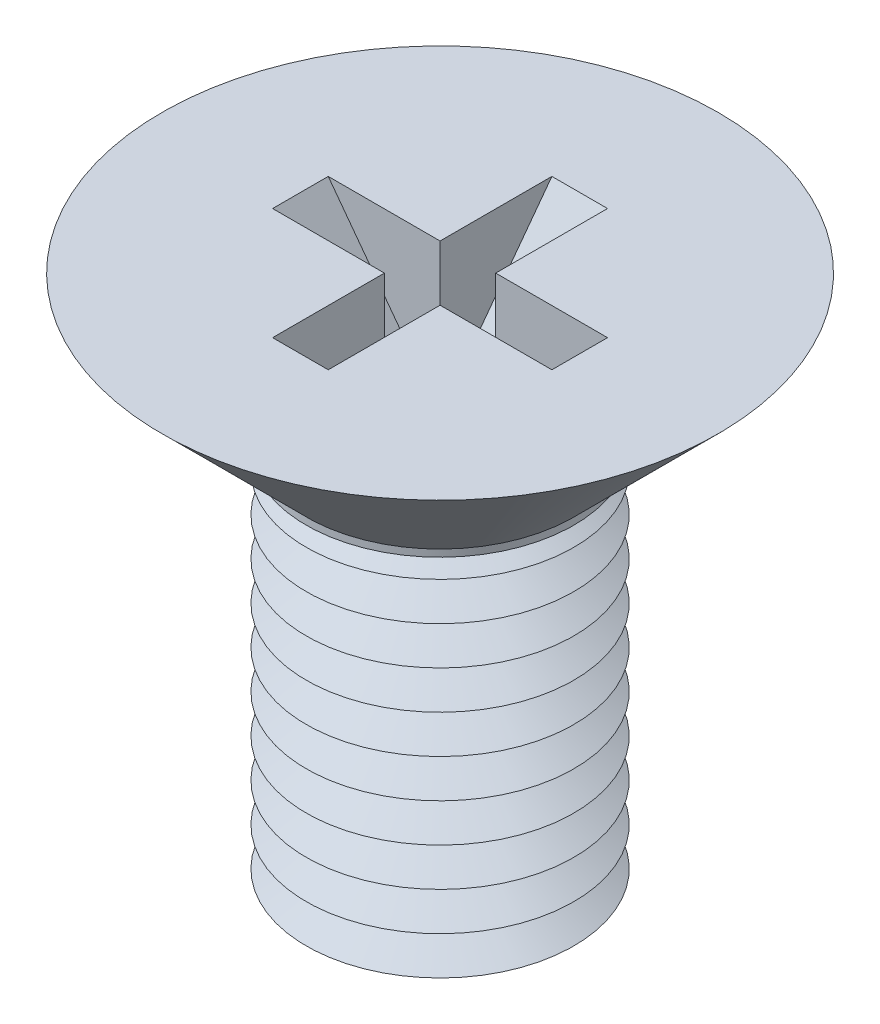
ISO-10303-21;
HEADER;
FILE_DESCRIPTION(('STEP AP214'),'2;1');
FILE_NAME('part.step','',(''),(''),'','','');
FILE_SCHEMA(('AUTOMOTIVE_DESIGN { 1 0 10303 214 1 1 1 1 }'));
ENDSEC;
DATA;
#1=APPLICATION_CONTEXT('core data for automotive mechanical design processes');
#2=APPLICATION_PROTOCOL_DEFINITION('international standard','automotive_design',2000,#1);
#3=PRODUCT_CONTEXT('',#1,'mechanical');
#4=PRODUCT('Part','Part','',(#3));
#5=PRODUCT_RELATED_PRODUCT_CATEGORY('part','',(#4));
#6=PRODUCT_DEFINITION_FORMATION('','',#4);
#7=PRODUCT_DEFINITION_CONTEXT('part definition',#1,'design');
#8=PRODUCT_DEFINITION('design','',#6,#7);
#9=PRODUCT_DEFINITION_SHAPE('','',#8);
#10=(LENGTH_UNIT() NAMED_UNIT(*) SI_UNIT(.MILLI.,.METRE.));
#11=(NAMED_UNIT(*) PLANE_ANGLE_UNIT() SI_UNIT($,.RADIAN.));
#12=(NAMED_UNIT(*) SI_UNIT($,.STERADIAN.) SOLID_ANGLE_UNIT());
#13=UNCERTAINTY_MEASURE_WITH_UNIT(LENGTH_MEASURE(1.E-05),#10,'distance_accuracy_value','');
#14=(GEOMETRIC_REPRESENTATION_CONTEXT(3) GLOBAL_UNCERTAINTY_ASSIGNED_CONTEXT((#13)) GLOBAL_UNIT_ASSIGNED_CONTEXT((#10,
#11,#12)) REPRESENTATION_CONTEXT('',''));
#15=CARTESIAN_POINT('',(0.,0.,0.));
#16=DIRECTION('',(0.,0.,1.));
#17=DIRECTION('',(1.,0.,0.));
#18=AXIS2_PLACEMENT_3D('',#15,#16,#17);
#19=CARTESIAN_POINT('',(2.61,2.7,-0.52));
#20=DIRECTION('',(0.801646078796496,-0.597798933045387,0.));
#21=DIRECTION('',(0.597798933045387,0.801646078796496,0.));
#22=AXIS2_PLACEMENT_3D('',#19,#20,#21);
#23=PLANE('',#22);
#24=DIRECTION('',(0.,0.,-1.));
#25=VECTOR('',#24,1.);
#26=CARTESIAN_POINT('',(0.52,-0.102681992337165,-0.52));
#27=LINE('',#26,#25);
#28=CARTESIAN_POINT('',(0.52,-0.102681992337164,0.52));
#29=VERTEX_POINT('',#28);
#30=CARTESIAN_POINT('',(0.52,-0.102681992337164,-0.52));
#31=VERTEX_POINT('',#30);
#32=EDGE_CURVE('E140',#29,#31,#27,.T.);
#33=ORIENTED_EDGE('',*,*,#32,.F.);
#34=DIRECTION('',(0.597798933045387,0.801646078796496,0.));
#35=VECTOR('',#34,1.);
#36=CARTESIAN_POINT('',(2.61,2.7,0.52));
#37=LINE('',#36,#35);
#38=CARTESIAN_POINT('',(2.61,2.7,0.52));
#39=VERTEX_POINT('',#38);
#40=EDGE_CURVE('E181',#29,#39,#37,.T.);
#41=ORIENTED_EDGE('',*,*,#40,.T.);
#42=DIRECTION('',(0.,0.,1.));
#43=VECTOR('',#42,1.);
#44=CARTESIAN_POINT('',(2.61,2.7,-0.52));
#45=LINE('',#44,#43);
#46=CARTESIAN_POINT('',(2.61,2.7,-0.52));
#47=VERTEX_POINT('',#46);
#48=EDGE_CURVE('E193',#47,#39,#45,.T.);
#49=ORIENTED_EDGE('',*,*,#48,.F.);
#50=DIRECTION('',(0.597798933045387,0.801646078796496,0.));
#51=VECTOR('',#50,1.);
#52=CARTESIAN_POINT('',(2.61,2.7,-0.52));
#53=LINE('',#52,#51);
#54=EDGE_CURVE('E188',#31,#47,#53,.T.);
#55=ORIENTED_EDGE('',*,*,#54,.F.);
#56=EDGE_LOOP('',(#33,#41,#49,#55));
#57=FACE_BOUND('',#56,.T.);
#58=ADVANCED_FACE('F33',(#57),#23,.F.);
#59=CARTESIAN_POINT('',(-2.61,4.05,-0.52));
#60=DIRECTION('',(0.,0.,-1.));
#61=DIRECTION('',(-1.,0.,0.));
#62=AXIS2_PLACEMENT_3D('',#59,#60,#61);
#63=PLANE('',#62);
#64=DIRECTION('',(0.597798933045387,-0.801646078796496,0.));
#65=VECTOR('',#64,1.);
#66=CARTESIAN_POINT('',(0.,-0.8,-0.52));
#67=LINE('',#66,#65);
#68=CARTESIAN_POINT('',(-2.61,2.7,-0.52));
#69=VERTEX_POINT('',#68);
#70=CARTESIAN_POINT('',(-0.52,-0.102681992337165,-0.52));
#71=VERTEX_POINT('',#70);
#72=EDGE_CURVE('E186',#69,#71,#67,.T.);
#73=ORIENTED_EDGE('',*,*,#72,.T.);
#74=DIRECTION('',(0.,1.,0.));
#75=VECTOR('',#74,1.);
#76=CARTESIAN_POINT('',(-0.52,4.05,-0.52));
#77=LINE('',#76,#75);
#78=CARTESIAN_POINT('',(-0.52,2.7,-0.52));
#79=VERTEX_POINT('',#78);
#80=EDGE_CURVE('E160',#71,#79,#77,.T.);
#81=ORIENTED_EDGE('',*,*,#80,.T.);
#82=DIRECTION('',(-1.,0.,0.));
#83=VECTOR('',#82,1.);
#84=CARTESIAN_POINT('',(5.2,2.7,-0.52));
#85=LINE('',#84,#83);
#86=EDGE_CURVE('E275',#79,#69,#85,.T.);
#87=ORIENTED_EDGE('',*,*,#86,.T.);
#88=EDGE_LOOP('',(#73,#81,#87));
#89=FACE_BOUND('',#88,.T.);
#90=ADVANCED_FACE('F291',(#89),#63,.F.);
#91=DIRECTION('',(0.,1.,0.));
#92=VECTOR('',#91,1.);
#93=CARTESIAN_POINT('',(0.52,4.05,-0.52));
#94=LINE('',#93,#92);
#95=CARTESIAN_POINT('',(0.52,2.7,-0.52));
#96=VERTEX_POINT('',#95);
#97=EDGE_CURVE('E139',#31,#96,#94,.T.);
#98=ORIENTED_EDGE('',*,*,#97,.F.);
#99=ORIENTED_EDGE('',*,*,#54,.T.);
#100=EDGE_CURVE('E276',#47,#96,#85,.T.);
#101=ORIENTED_EDGE('',*,*,#100,.T.);
#102=EDGE_LOOP('',(#98,#99,#101));
#103=FACE_BOUND('',#102,.T.);
#104=ADVANCED_FACE('F336',(#103),#63,.F.);
#105=CARTESIAN_POINT('',(-2.61,4.05,0.52));
#106=DIRECTION('',(0.,0.,-1.));
#107=DIRECTION('',(-1.,0.,0.));
#108=AXIS2_PLACEMENT_3D('',#105,#106,#107);
#109=PLANE('',#108);
#110=DIRECTION('',(0.,1.,0.));
#111=VECTOR('',#110,1.);
#112=CARTESIAN_POINT('',(-0.52,4.05,0.52));
#113=LINE('',#112,#111);
#114=CARTESIAN_POINT('',(-0.52,-0.102681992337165,0.52));
#115=VERTEX_POINT('',#114);
#116=CARTESIAN_POINT('',(-0.52,2.7,0.52));
#117=VERTEX_POINT('',#116);
#118=EDGE_CURVE('E41',#115,#117,#113,.T.);
#119=ORIENTED_EDGE('',*,*,#118,.F.);
#120=DIRECTION('',(0.597798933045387,-0.801646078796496,0.));
#121=VECTOR('',#120,1.);
#122=CARTESIAN_POINT('',(0.,-0.8,0.52));
#123=LINE('',#122,#121);
#124=CARTESIAN_POINT('',(-2.61,2.7,0.52));
#125=VERTEX_POINT('',#124);
#126=EDGE_CURVE('E179',#125,#115,#123,.T.);
#127=ORIENTED_EDGE('',*,*,#126,.F.);
#128=DIRECTION('',(-1.,0.,0.));
#129=VECTOR('',#128,1.);
#130=CARTESIAN_POINT('',(5.2,2.7,0.52));
#131=LINE('',#130,#129);
#132=EDGE_CURVE('E273',#117,#125,#131,.T.);
#133=ORIENTED_EDGE('',*,*,#132,.F.);
#134=EDGE_LOOP('',(#119,#127,#133));
#135=FACE_BOUND('',#134,.T.);
#136=ADVANCED_FACE('F286',(#135),#109,.T.);
#137=ORIENTED_EDGE('',*,*,#40,.F.);
#138=DIRECTION('',(0.,1.,0.));
#139=VECTOR('',#138,1.);
#140=CARTESIAN_POINT('',(0.52,4.05,0.52));
#141=LINE('',#140,#139);
#142=CARTESIAN_POINT('',(0.52,2.7,0.52));
#143=VERTEX_POINT('',#142);
#144=EDGE_CURVE('E128',#29,#143,#141,.T.);
#145=ORIENTED_EDGE('',*,*,#144,.T.);
#146=EDGE_CURVE('E138',#39,#143,#131,.T.);
#147=ORIENTED_EDGE('',*,*,#146,.F.);
#148=EDGE_LOOP('',(#137,#145,#147));
#149=FACE_BOUND('',#148,.T.);
#150=ADVANCED_FACE('F339',(#149),#109,.T.);
#151=CARTESIAN_POINT('',(0.,0.,0.));
#152=DIRECTION('',(0.,1.,0.));
#153=DIRECTION('',(0.,0.,1.));
#154=AXIS2_PLACEMENT_3D('',#151,#152,#153);
#155=CONICAL_SURFACE('',#154,2.5,0.785398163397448);
#156=CARTESIAN_POINT('',(0.,2.7,0.));
#157=DIRECTION('',(0.,-1.,0.));
#158=DIRECTION('',(0.,0.,-1.));
#159=AXIS2_PLACEMENT_3D('',#156,#157,#158);
#160=CIRCLE('',#159,5.2);
#161=CARTESIAN_POINT('',(0.,2.7,-5.2));
#162=VERTEX_POINT('',#161);
#163=EDGE_CURVE('E267',#162,#162,#160,.T.);
#164=ORIENTED_EDGE('',*,*,#163,.T.);
#165=EDGE_LOOP('',(#164));
#166=FACE_BOUND('',#165,.T.);
#167=CARTESIAN_POINT('',(0.,0.,0.));
#168=DIRECTION('',(0.,-1.,0.));
#169=DIRECTION('',(0.,0.,-1.));
#170=AXIS2_PLACEMENT_3D('',#167,#168,#169);
#171=CIRCLE('',#170,2.5);
#172=CARTESIAN_POINT('',(0.,0.,-2.5));
#173=VERTEX_POINT('',#172);
#174=EDGE_CURVE('E270',#173,#173,#171,.T.);
#175=ORIENTED_EDGE('',*,*,#174,.F.);
#176=EDGE_LOOP('',(#175));
#177=FACE_BOUND('',#176,.T.);
#178=ADVANCED_FACE('F35',(#166,#177),#155,.T.);
#179=CARTESIAN_POINT('',(5.2,2.7,0.));
#180=DIRECTION('',(0.,1.,0.));
#181=DIRECTION('',(0.,0.,1.));
#182=AXIS2_PLACEMENT_3D('',#179,#180,#181);
#183=PLANE('',#182);
#184=DIRECTION('',(0.,0.,1.));
#185=VECTOR('',#184,1.);
#186=CARTESIAN_POINT('',(-0.52,2.7,0.));
#187=LINE('',#186,#185);
#188=CARTESIAN_POINT('',(-0.52,2.7,-2.61));
#189=VERTEX_POINT('',#188);
#190=EDGE_CURVE('E162',#189,#79,#187,.T.);
#191=ORIENTED_EDGE('',*,*,#190,.F.);
#192=DIRECTION('',(1.,0.,0.));
#193=VECTOR('',#192,1.);
#194=CARTESIAN_POINT('',(-0.52,2.7,-2.61));
#195=LINE('',#194,#193);
#196=CARTESIAN_POINT('',(0.52,2.7,-2.61));
#197=VERTEX_POINT('',#196);
#198=EDGE_CURVE('E145',#189,#197,#195,.T.);
#199=ORIENTED_EDGE('',*,*,#198,.T.);
#200=DIRECTION('',(0.,0.,1.));
#201=VECTOR('',#200,1.);
#202=CARTESIAN_POINT('',(0.52,2.7,0.));
#203=LINE('',#202,#201);
#204=EDGE_CURVE('E142',#197,#96,#203,.T.);
#205=ORIENTED_EDGE('',*,*,#204,.T.);
#206=ORIENTED_EDGE('',*,*,#100,.F.);
#207=ORIENTED_EDGE('',*,*,#48,.T.);
#208=ORIENTED_EDGE('',*,*,#146,.T.);
#209=CARTESIAN_POINT('',(0.52,2.7,2.61));
#210=VERTEX_POINT('',#209);
#211=EDGE_CURVE('E126',#143,#210,#203,.T.);
#212=ORIENTED_EDGE('',*,*,#211,.T.);
#213=DIRECTION('',(1.,0.,0.));
#214=VECTOR('',#213,1.);
#215=CARTESIAN_POINT('',(-0.52,2.7,2.61));
#216=LINE('',#215,#214);
#217=CARTESIAN_POINT('',(-0.52,2.7,2.61));
#218=VERTEX_POINT('',#217);
#219=EDGE_CURVE('E113',#218,#210,#216,.T.);
#220=ORIENTED_EDGE('',*,*,#219,.F.);
#221=EDGE_CURVE('E153',#117,#218,#187,.T.);
#222=ORIENTED_EDGE('',*,*,#221,.F.);
#223=ORIENTED_EDGE('',*,*,#132,.T.);
#224=DIRECTION('',(0.,0.,1.));
#225=VECTOR('',#224,1.);
#226=CARTESIAN_POINT('',(-2.61,2.7,-0.52));
#227=LINE('',#226,#225);
#228=EDGE_CURVE('E192',#69,#125,#227,.T.);
#229=ORIENTED_EDGE('',*,*,#228,.F.);
#230=ORIENTED_EDGE('',*,*,#86,.F.);
#231=EDGE_LOOP('',(#191,#199,#205,#206,#207,#208,#212,#220,#222,#223,#229,#230));
#232=FACE_BOUND('',#231,.T.);
#233=ORIENTED_EDGE('',*,*,#163,.F.);
#234=EDGE_LOOP('',(#233));
#235=FACE_BOUND('',#234,.T.);
#236=ADVANCED_FACE('F134',(#232,#235),#183,.T.);
#237=CARTESIAN_POINT('',(0.,-7.3,0.));
#238=DIRECTION('',(0.,-1.,0.));
#239=DIRECTION('',(0.,0.,-1.));
#240=AXIS2_PLACEMENT_3D('',#237,#238,#239);
#241=PLANE('',#240);
#242=CARTESIAN_POINT('',(0.,-7.3,0.));
#243=DIRECTION('',(0.,-1.,0.));
#244=DIRECTION('',(0.,0.,-1.));
#245=AXIS2_PLACEMENT_3D('',#242,#243,#244);
#246=CIRCLE('',#245,1.879225);
#247=CARTESIAN_POINT('',(0.,-7.3,-1.879225));
#248=VERTEX_POINT('',#247);
#249=EDGE_CURVE('E264',#248,#248,#246,.T.);
#250=ORIENTED_EDGE('',*,*,#249,.T.);
#251=EDGE_LOOP('',(#250));
#252=FACE_BOUND('',#251,.T.);
#253=ADVANCED_FACE('F471',(#252),#241,.T.);
#254=CARTESIAN_POINT('',(0.,-7.3,0.));
#255=DIRECTION('',(0.,1.,0.));
#256=DIRECTION('',(0.,0.,1.));
#257=AXIS2_PLACEMENT_3D('',#254,#255,#256);
#258=CONICAL_SURFACE('',#257,1.879225,1.0471975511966);
#259=CARTESIAN_POINT('',(0.,-6.94159538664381,0.));
#260=DIRECTION('',(0.,-1.,0.));
#261=DIRECTION('',(0.,0.,-1.));
#262=AXIS2_PLACEMENT_3D('',#259,#260,#261);
#263=CIRCLE('',#262,2.5);
#264=CARTESIAN_POINT('',(0.,-6.94159538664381,-2.5));
#265=VERTEX_POINT('',#264);
#266=EDGE_CURVE('E261',#265,#265,#263,.T.);
#267=ORIENTED_EDGE('',*,*,#266,.T.);
#268=EDGE_LOOP('',(#267));
#269=FACE_BOUND('',#268,.T.);
#270=ORIENTED_EDGE('',*,*,#249,.F.);
#271=EDGE_LOOP('',(#270));
#272=FACE_BOUND('',#271,.T.);
#273=ADVANCED_FACE('F467',(#269,#272),#258,.T.);
#274=CARTESIAN_POINT('',(0.,-6.94159538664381,0.));
#275=DIRECTION('',(0.,-1.,0.));
#276=DIRECTION('',(0.,0.,-1.));
#277=AXIS2_PLACEMENT_3D('',#274,#275,#276);
#278=CONICAL_SURFACE('',#277,2.5,1.0471975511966);
#279=CARTESIAN_POINT('',(0.,-6.58319077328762,0.));
#280=DIRECTION('',(0.,-1.,0.));
#281=DIRECTION('',(0.,0.,-1.));
#282=AXIS2_PLACEMENT_3D('',#279,#280,#281);
#283=CIRCLE('',#282,1.879225);
#284=CARTESIAN_POINT('',(0.,-6.58319077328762,-1.879225));
#285=VERTEX_POINT('',#284);
#286=EDGE_CURVE('E258',#285,#285,#283,.T.);
#287=ORIENTED_EDGE('',*,*,#286,.T.);
#288=EDGE_LOOP('',(#287));
#289=FACE_BOUND('',#288,.T.);
#290=ORIENTED_EDGE('',*,*,#266,.F.);
#291=EDGE_LOOP('',(#290));
#292=FACE_BOUND('',#291,.T.);
#293=ADVANCED_FACE('F463',(#289,#292),#278,.T.);
#294=CARTESIAN_POINT('',(0.,-6.58319077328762,0.));
#295=DIRECTION('',(0.,1.,0.));
#296=DIRECTION('',(0.,0.,1.));
#297=AXIS2_PLACEMENT_3D('',#294,#295,#296);
#298=CONICAL_SURFACE('',#297,1.879225,1.0471975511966);
#299=CARTESIAN_POINT('',(0.,-6.22478615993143,0.));
#300=DIRECTION('',(0.,-1.,0.));
#301=DIRECTION('',(0.,0.,-1.));
#302=AXIS2_PLACEMENT_3D('',#299,#300,#301);
#303=CIRCLE('',#302,2.5);
#304=CARTESIAN_POINT('',(0.,-6.22478615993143,-2.5));
#305=VERTEX_POINT('',#304);
#306=EDGE_CURVE('E255',#305,#305,#303,.T.);
#307=ORIENTED_EDGE('',*,*,#306,.T.);
#308=EDGE_LOOP('',(#307));
#309=FACE_BOUND('',#308,.T.);
#310=ORIENTED_EDGE('',*,*,#286,.F.);
#311=EDGE_LOOP('',(#310));
#312=FACE_BOUND('',#311,.T.);
#313=ADVANCED_FACE('F459',(#309,#312),#298,.T.);
#314=CARTESIAN_POINT('',(0.,-6.22478615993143,0.));
#315=DIRECTION('',(0.,-1.,0.));
#316=DIRECTION('',(0.,0.,-1.));
#317=AXIS2_PLACEMENT_3D('',#314,#315,#316);
#318=CONICAL_SURFACE('',#317,2.5,1.0471975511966);
#319=CARTESIAN_POINT('',(0.,-5.86638154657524,0.));
#320=DIRECTION('',(0.,-1.,0.));
#321=DIRECTION('',(0.,0.,-1.));
#322=AXIS2_PLACEMENT_3D('',#319,#320,#321);
#323=CIRCLE('',#322,1.879225);
#324=CARTESIAN_POINT('',(0.,-5.86638154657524,-1.879225));
#325=VERTEX_POINT('',#324);
#326=EDGE_CURVE('E252',#325,#325,#323,.T.);
#327=ORIENTED_EDGE('',*,*,#326,.T.);
#328=EDGE_LOOP('',(#327));
#329=FACE_BOUND('',#328,.T.);
#330=ORIENTED_EDGE('',*,*,#306,.F.);
#331=EDGE_LOOP('',(#330));
#332=FACE_BOUND('',#331,.T.);
#333=ADVANCED_FACE('F455',(#329,#332),#318,.T.);
#334=CARTESIAN_POINT('',(0.,-5.86638154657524,0.));
#335=DIRECTION('',(0.,1.,0.));
#336=DIRECTION('',(0.,0.,1.));
#337=AXIS2_PLACEMENT_3D('',#334,#335,#336);
#338=CONICAL_SURFACE('',#337,1.879225,1.0471975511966);
#339=CARTESIAN_POINT('',(0.,-5.50797693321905,0.));
#340=DIRECTION('',(0.,-1.,0.));
#341=DIRECTION('',(0.,0.,-1.));
#342=AXIS2_PLACEMENT_3D('',#339,#340,#341);
#343=CIRCLE('',#342,2.5);
#344=CARTESIAN_POINT('',(0.,-5.50797693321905,-2.5));
#345=VERTEX_POINT('',#344);
#346=EDGE_CURVE('E249',#345,#345,#343,.T.);
#347=ORIENTED_EDGE('',*,*,#346,.T.);
#348=EDGE_LOOP('',(#347));
#349=FACE_BOUND('',#348,.T.);
#350=ORIENTED_EDGE('',*,*,#326,.F.);
#351=EDGE_LOOP('',(#350));
#352=FACE_BOUND('',#351,.T.);
#353=ADVANCED_FACE('F451',(#349,#352),#338,.T.);
#354=CARTESIAN_POINT('',(0.,-5.50797693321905,0.));
#355=DIRECTION('',(0.,-1.,0.));
#356=DIRECTION('',(0.,0.,-1.));
#357=AXIS2_PLACEMENT_3D('',#354,#355,#356);
#358=CONICAL_SURFACE('',#357,2.5,1.0471975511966);
#359=CARTESIAN_POINT('',(0.,-5.14957231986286,0.));
#360=DIRECTION('',(0.,-1.,0.));
#361=DIRECTION('',(0.,0.,-1.));
#362=AXIS2_PLACEMENT_3D('',#359,#360,#361);
#363=CIRCLE('',#362,1.879225);
#364=CARTESIAN_POINT('',(0.,-5.14957231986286,-1.879225));
#365=VERTEX_POINT('',#364);
#366=EDGE_CURVE('E246',#365,#365,#363,.T.);
#367=ORIENTED_EDGE('',*,*,#366,.T.);
#368=EDGE_LOOP('',(#367));
#369=FACE_BOUND('',#368,.T.);
#370=ORIENTED_EDGE('',*,*,#346,.F.);
#371=EDGE_LOOP('',(#370));
#372=FACE_BOUND('',#371,.T.);
#373=ADVANCED_FACE('F447',(#369,#372),#358,.T.);
#374=CARTESIAN_POINT('',(0.,-5.14957231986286,0.));
#375=DIRECTION('',(0.,1.,0.));
#376=DIRECTION('',(0.,0.,1.));
#377=AXIS2_PLACEMENT_3D('',#374,#375,#376);
#378=CONICAL_SURFACE('',#377,1.879225,1.0471975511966);
#379=CARTESIAN_POINT('',(0.,-4.79116770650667,0.));
#380=DIRECTION('',(0.,-1.,0.));
#381=DIRECTION('',(0.,0.,-1.));
#382=AXIS2_PLACEMENT_3D('',#379,#380,#381);
#383=CIRCLE('',#382,2.5);
#384=CARTESIAN_POINT('',(0.,-4.79116770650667,-2.5));
#385=VERTEX_POINT('',#384);
#386=EDGE_CURVE('E243',#385,#385,#383,.T.);
#387=ORIENTED_EDGE('',*,*,#386,.T.);
#388=EDGE_LOOP('',(#387));
#389=FACE_BOUND('',#388,.T.);
#390=ORIENTED_EDGE('',*,*,#366,.F.);
#391=EDGE_LOOP('',(#390));
#392=FACE_BOUND('',#391,.T.);
#393=ADVANCED_FACE('F443',(#389,#392),#378,.T.);
#394=CARTESIAN_POINT('',(0.,-4.79116770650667,0.));
#395=DIRECTION('',(0.,-1.,0.));
#396=DIRECTION('',(0.,0.,-1.));
#397=AXIS2_PLACEMENT_3D('',#394,#395,#396);
#398=CONICAL_SURFACE('',#397,2.5,1.0471975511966);
#399=CARTESIAN_POINT('',(0.,-4.43276309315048,0.));
#400=DIRECTION('',(0.,-1.,0.));
#401=DIRECTION('',(0.,0.,-1.));
#402=AXIS2_PLACEMENT_3D('',#399,#400,#401);
#403=CIRCLE('',#402,1.879225);
#404=CARTESIAN_POINT('',(0.,-4.43276309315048,-1.879225));
#405=VERTEX_POINT('',#404);
#406=EDGE_CURVE('E240',#405,#405,#403,.T.);
#407=ORIENTED_EDGE('',*,*,#406,.T.);
#408=EDGE_LOOP('',(#407));
#409=FACE_BOUND('',#408,.T.);
#410=ORIENTED_EDGE('',*,*,#386,.F.);
#411=EDGE_LOOP('',(#410));
#412=FACE_BOUND('',#411,.T.);
#413=ADVANCED_FACE('F439',(#409,#412),#398,.T.);
#414=CARTESIAN_POINT('',(0.,-4.43276309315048,0.));
#415=DIRECTION('',(0.,1.,0.));
#416=DIRECTION('',(0.,0.,1.));
#417=AXIS2_PLACEMENT_3D('',#414,#415,#416);
#418=CONICAL_SURFACE('',#417,1.879225,1.0471975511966);
#419=CARTESIAN_POINT('',(0.,-4.07435847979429,0.));
#420=DIRECTION('',(0.,-1.,0.));
#421=DIRECTION('',(0.,0.,-1.));
#422=AXIS2_PLACEMENT_3D('',#419,#420,#421);
#423=CIRCLE('',#422,2.5);
#424=CARTESIAN_POINT('',(0.,-4.07435847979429,-2.5));
#425=VERTEX_POINT('',#424);
#426=EDGE_CURVE('E237',#425,#425,#423,.T.);
#427=ORIENTED_EDGE('',*,*,#426,.T.);
#428=EDGE_LOOP('',(#427));
#429=FACE_BOUND('',#428,.T.);
#430=ORIENTED_EDGE('',*,*,#406,.F.);
#431=EDGE_LOOP('',(#430));
#432=FACE_BOUND('',#431,.T.);
#433=ADVANCED_FACE('F435',(#429,#432),#418,.T.);
#434=CARTESIAN_POINT('',(0.,-4.07435847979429,0.));
#435=DIRECTION('',(0.,-1.,0.));
#436=DIRECTION('',(0.,0.,-1.));
#437=AXIS2_PLACEMENT_3D('',#434,#435,#436);
#438=CONICAL_SURFACE('',#437,2.5,1.0471975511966);
#439=CARTESIAN_POINT('',(0.,-3.7159538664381,0.));
#440=DIRECTION('',(0.,-1.,0.));
#441=DIRECTION('',(0.,0.,-1.));
#442=AXIS2_PLACEMENT_3D('',#439,#440,#441);
#443=CIRCLE('',#442,1.879225);
#444=CARTESIAN_POINT('',(0.,-3.7159538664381,-1.879225));
#445=VERTEX_POINT('',#444);
#446=EDGE_CURVE('E234',#445,#445,#443,.T.);
#447=ORIENTED_EDGE('',*,*,#446,.T.);
#448=EDGE_LOOP('',(#447));
#449=FACE_BOUND('',#448,.T.);
#450=ORIENTED_EDGE('',*,*,#426,.F.);
#451=EDGE_LOOP('',(#450));
#452=FACE_BOUND('',#451,.T.);
#453=ADVANCED_FACE('F431',(#449,#452),#438,.T.);
#454=CARTESIAN_POINT('',(0.,-3.7159538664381,0.));
#455=DIRECTION('',(0.,1.,0.));
#456=DIRECTION('',(0.,0.,1.));
#457=AXIS2_PLACEMENT_3D('',#454,#455,#456);
#458=CONICAL_SURFACE('',#457,1.879225,1.0471975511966);
#459=CARTESIAN_POINT('',(0.,-3.35754925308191,0.));
#460=DIRECTION('',(0.,-1.,0.));
#461=DIRECTION('',(0.,0.,-1.));
#462=AXIS2_PLACEMENT_3D('',#459,#460,#461);
#463=CIRCLE('',#462,2.5);
#464=CARTESIAN_POINT('',(0.,-3.35754925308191,-2.5));
#465=VERTEX_POINT('',#464);
#466=EDGE_CURVE('E231',#465,#465,#463,.T.);
#467=ORIENTED_EDGE('',*,*,#466,.T.);
#468=EDGE_LOOP('',(#467));
#469=FACE_BOUND('',#468,.T.);
#470=ORIENTED_EDGE('',*,*,#446,.F.);
#471=EDGE_LOOP('',(#470));
#472=FACE_BOUND('',#471,.T.);
#473=ADVANCED_FACE('F427',(#469,#472),#458,.T.);
#474=CARTESIAN_POINT('',(0.,-3.35754925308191,0.));
#475=DIRECTION('',(0.,-1.,0.));
#476=DIRECTION('',(0.,0.,-1.));
#477=AXIS2_PLACEMENT_3D('',#474,#475,#476);
#478=CONICAL_SURFACE('',#477,2.5,1.0471975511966);
#479=CARTESIAN_POINT('',(0.,-2.99914463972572,0.));
#480=DIRECTION('',(0.,-1.,0.));
#481=DIRECTION('',(0.,0.,-1.));
#482=AXIS2_PLACEMENT_3D('',#479,#480,#481);
#483=CIRCLE('',#482,1.879225);
#484=CARTESIAN_POINT('',(0.,-2.99914463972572,-1.879225));
#485=VERTEX_POINT('',#484);
#486=EDGE_CURVE('E228',#485,#485,#483,.T.);
#487=ORIENTED_EDGE('',*,*,#486,.T.);
#488=EDGE_LOOP('',(#487));
#489=FACE_BOUND('',#488,.T.);
#490=ORIENTED_EDGE('',*,*,#466,.F.);
#491=EDGE_LOOP('',(#490));
#492=FACE_BOUND('',#491,.T.);
#493=ADVANCED_FACE('F423',(#489,#492),#478,.T.);
#494=CARTESIAN_POINT('',(0.,-2.99914463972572,0.));
#495=DIRECTION('',(0.,1.,0.));
#496=DIRECTION('',(0.,0.,1.));
#497=AXIS2_PLACEMENT_3D('',#494,#495,#496);
#498=CONICAL_SURFACE('',#497,1.879225,1.0471975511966);
#499=CARTESIAN_POINT('',(0.,-2.64074002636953,0.));
#500=DIRECTION('',(0.,-1.,0.));
#501=DIRECTION('',(0.,0.,-1.));
#502=AXIS2_PLACEMENT_3D('',#499,#500,#501);
#503=CIRCLE('',#502,2.5);
#504=CARTESIAN_POINT('',(0.,-2.64074002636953,-2.5));
#505=VERTEX_POINT('',#504);
#506=EDGE_CURVE('E225',#505,#505,#503,.T.);
#507=ORIENTED_EDGE('',*,*,#506,.T.);
#508=EDGE_LOOP('',(#507));
#509=FACE_BOUND('',#508,.T.);
#510=ORIENTED_EDGE('',*,*,#486,.F.);
#511=EDGE_LOOP('',(#510));
#512=FACE_BOUND('',#511,.T.);
#513=ADVANCED_FACE('F419',(#509,#512),#498,.T.);
#514=CARTESIAN_POINT('',(0.,-2.64074002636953,0.));
#515=DIRECTION('',(0.,-1.,0.));
#516=DIRECTION('',(0.,0.,-1.));
#517=AXIS2_PLACEMENT_3D('',#514,#515,#516);
#518=CONICAL_SURFACE('',#517,2.5,1.0471975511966);
#519=CARTESIAN_POINT('',(0.,-2.28233541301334,0.));
#520=DIRECTION('',(0.,-1.,0.));
#521=DIRECTION('',(0.,0.,-1.));
#522=AXIS2_PLACEMENT_3D('',#519,#520,#521);
#523=CIRCLE('',#522,1.879225);
#524=CARTESIAN_POINT('',(0.,-2.28233541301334,-1.879225));
#525=VERTEX_POINT('',#524);
#526=EDGE_CURVE('E222',#525,#525,#523,.T.);
#527=ORIENTED_EDGE('',*,*,#526,.T.);
#528=EDGE_LOOP('',(#527));
#529=FACE_BOUND('',#528,.T.);
#530=ORIENTED_EDGE('',*,*,#506,.F.);
#531=EDGE_LOOP('',(#530));
#532=FACE_BOUND('',#531,.T.);
#533=ADVANCED_FACE('F415',(#529,#532),#518,.T.);
#534=CARTESIAN_POINT('',(0.,-2.28233541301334,0.));
#535=DIRECTION('',(0.,1.,0.));
#536=DIRECTION('',(0.,0.,1.));
#537=AXIS2_PLACEMENT_3D('',#534,#535,#536);
#538=CONICAL_SURFACE('',#537,1.879225,1.0471975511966);
#539=CARTESIAN_POINT('',(0.,-1.92393079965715,0.));
#540=DIRECTION('',(0.,-1.,0.));
#541=DIRECTION('',(0.,0.,-1.));
#542=AXIS2_PLACEMENT_3D('',#539,#540,#541);
#543=CIRCLE('',#542,2.5);
#544=CARTESIAN_POINT('',(0.,-1.92393079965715,-2.5));
#545=VERTEX_POINT('',#544);
#546=EDGE_CURVE('E219',#545,#545,#543,.T.);
#547=ORIENTED_EDGE('',*,*,#546,.T.);
#548=EDGE_LOOP('',(#547));
#549=FACE_BOUND('',#548,.T.);
#550=ORIENTED_EDGE('',*,*,#526,.F.);
#551=EDGE_LOOP('',(#550));
#552=FACE_BOUND('',#551,.T.);
#553=ADVANCED_FACE('F411',(#549,#552),#538,.T.);
#554=CARTESIAN_POINT('',(0.,-1.92393079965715,0.));
#555=DIRECTION('',(0.,-1.,0.));
#556=DIRECTION('',(0.,0.,-1.));
#557=AXIS2_PLACEMENT_3D('',#554,#555,#556);
#558=CONICAL_SURFACE('',#557,2.5,1.0471975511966);
#559=CARTESIAN_POINT('',(0.,-1.56552618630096,0.));
#560=DIRECTION('',(0.,-1.,0.));
#561=DIRECTION('',(0.,0.,-1.));
#562=AXIS2_PLACEMENT_3D('',#559,#560,#561);
#563=CIRCLE('',#562,1.879225);
#564=CARTESIAN_POINT('',(0.,-1.56552618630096,-1.879225));
#565=VERTEX_POINT('',#564);
#566=EDGE_CURVE('E216',#565,#565,#563,.T.);
#567=ORIENTED_EDGE('',*,*,#566,.T.);
#568=EDGE_LOOP('',(#567));
#569=FACE_BOUND('',#568,.T.);
#570=ORIENTED_EDGE('',*,*,#546,.F.);
#571=EDGE_LOOP('',(#570));
#572=FACE_BOUND('',#571,.T.);
#573=ADVANCED_FACE('F407',(#569,#572),#558,.T.);
#574=CARTESIAN_POINT('',(0.,-1.56552618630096,0.));
#575=DIRECTION('',(0.,1.,0.));
#576=DIRECTION('',(0.,0.,1.));
#577=AXIS2_PLACEMENT_3D('',#574,#575,#576);
#578=CONICAL_SURFACE('',#577,1.879225,1.0471975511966);
#579=CARTESIAN_POINT('',(0.,-1.20712157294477,0.));
#580=DIRECTION('',(0.,-1.,0.));
#581=DIRECTION('',(0.,0.,-1.));
#582=AXIS2_PLACEMENT_3D('',#579,#580,#581);
#583=CIRCLE('',#582,2.5);
#584=CARTESIAN_POINT('',(0.,-1.20712157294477,-2.5));
#585=VERTEX_POINT('',#584);
#586=EDGE_CURVE('E213',#585,#585,#583,.T.);
#587=ORIENTED_EDGE('',*,*,#586,.T.);
#588=EDGE_LOOP('',(#587));
#589=FACE_BOUND('',#588,.T.);
#590=ORIENTED_EDGE('',*,*,#566,.F.);
#591=EDGE_LOOP('',(#590));
#592=FACE_BOUND('',#591,.T.);
#593=ADVANCED_FACE('F403',(#589,#592),#578,.T.);
#594=CARTESIAN_POINT('',(0.,-1.20712157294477,0.));
#595=DIRECTION('',(0.,-1.,0.));
#596=DIRECTION('',(0.,0.,-1.));
#597=AXIS2_PLACEMENT_3D('',#594,#595,#596);
#598=CONICAL_SURFACE('',#597,2.5,1.0471975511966);
#599=CARTESIAN_POINT('',(0.,-0.848716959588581,0.));
#600=DIRECTION('',(0.,-1.,0.));
#601=DIRECTION('',(0.,0.,-1.));
#602=AXIS2_PLACEMENT_3D('',#599,#600,#601);
#603=CIRCLE('',#602,1.879225);
#604=CARTESIAN_POINT('',(0.,-0.848716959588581,-1.879225));
#605=VERTEX_POINT('',#604);
#606=EDGE_CURVE('E210',#605,#605,#603,.T.);
#607=ORIENTED_EDGE('',*,*,#606,.T.);
#608=EDGE_LOOP('',(#607));
#609=FACE_BOUND('',#608,.T.);
#610=ORIENTED_EDGE('',*,*,#586,.F.);
#611=EDGE_LOOP('',(#610));
#612=FACE_BOUND('',#611,.T.);
#613=ADVANCED_FACE('F399',(#609,#612),#598,.T.);
#614=CARTESIAN_POINT('',(0.,-0.848716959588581,0.));
#615=DIRECTION('',(0.,1.,0.));
#616=DIRECTION('',(0.,0.,1.));
#617=AXIS2_PLACEMENT_3D('',#614,#615,#616);
#618=CONICAL_SURFACE('',#617,1.879225,1.0471975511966);
#619=CARTESIAN_POINT('',(0.,-0.490312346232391,0.));
#620=DIRECTION('',(0.,-1.,0.));
#621=DIRECTION('',(0.,0.,-1.));
#622=AXIS2_PLACEMENT_3D('',#619,#620,#621);
#623=CIRCLE('',#622,2.5);
#624=CARTESIAN_POINT('',(0.,-0.490312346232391,-2.5));
#625=VERTEX_POINT('',#624);
#626=EDGE_CURVE('E207',#625,#625,#623,.T.);
#627=ORIENTED_EDGE('',*,*,#626,.T.);
#628=EDGE_LOOP('',(#627));
#629=FACE_BOUND('',#628,.T.);
#630=ORIENTED_EDGE('',*,*,#606,.F.);
#631=EDGE_LOOP('',(#630));
#632=FACE_BOUND('',#631,.T.);
#633=ADVANCED_FACE('F395',(#629,#632),#618,.T.);
#634=CARTESIAN_POINT('',(0.,-0.490312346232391,0.));
#635=DIRECTION('',(0.,-1.,0.));
#636=DIRECTION('',(0.,0.,-1.));
#637=AXIS2_PLACEMENT_3D('',#634,#635,#636);
#638=CONICAL_SURFACE('',#637,2.5,1.0471975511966);
#639=CARTESIAN_POINT('',(0.,-0.131907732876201,0.));
#640=DIRECTION('',(0.,-1.,0.));
#641=DIRECTION('',(0.,0.,-1.));
#642=AXIS2_PLACEMENT_3D('',#639,#640,#641);
#643=CIRCLE('',#642,1.879225);
#644=CARTESIAN_POINT('',(0.,-0.131907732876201,-1.879225));
#645=VERTEX_POINT('',#644);
#646=EDGE_CURVE('E204',#645,#645,#643,.T.);
#647=ORIENTED_EDGE('',*,*,#646,.T.);
#648=EDGE_LOOP('',(#647));
#649=FACE_BOUND('',#648,.T.);
#650=ORIENTED_EDGE('',*,*,#626,.F.);
#651=EDGE_LOOP('',(#650));
#652=FACE_BOUND('',#651,.T.);
#653=ADVANCED_FACE('F388',(#649,#652),#638,.T.);
#654=CARTESIAN_POINT('',(1.879225,-0.131907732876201,0.));
#655=DIRECTION('',(0.,-1.,0.));
#656=DIRECTION('',(0.,0.,-1.));
#657=AXIS2_PLACEMENT_3D('',#654,#655,#656);
#658=PLANE('',#657);
#659=CARTESIAN_POINT('',(0.,-0.131907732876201,0.));
#660=DIRECTION('',(0.,-1.,0.));
#661=DIRECTION('',(0.,0.,-1.));
#662=AXIS2_PLACEMENT_3D('',#659,#660,#661);
#663=CIRCLE('',#662,2.5);
#664=CARTESIAN_POINT('',(0.,-0.131907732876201,-2.5));
#665=VERTEX_POINT('',#664);
#666=EDGE_CURVE('E195',#665,#665,#663,.T.);
#667=ORIENTED_EDGE('',*,*,#666,.T.);
#668=EDGE_LOOP('',(#667));
#669=FACE_BOUND('',#668,.T.);
#670=ORIENTED_EDGE('',*,*,#646,.F.);
#671=EDGE_LOOP('',(#670));
#672=FACE_BOUND('',#671,.T.);
#673=ADVANCED_FACE('F383',(#669,#672),#658,.T.);
#674=CARTESIAN_POINT('',(0.,0.,0.));
#675=DIRECTION('',(0.,-1.,0.));
#676=DIRECTION('',(0.,0.,-1.));
#677=AXIS2_PLACEMENT_3D('',#674,#675,#676);
#678=CYLINDRICAL_SURFACE('',#677,2.5);
#679=ORIENTED_EDGE('',*,*,#174,.T.);
#680=EDGE_LOOP('',(#679));
#681=FACE_BOUND('',#680,.T.);
#682=ORIENTED_EDGE('',*,*,#666,.F.);
#683=EDGE_LOOP('',(#682));
#684=FACE_BOUND('',#683,.T.);
#685=ADVANCED_FACE('F378',(#681,#684),#678,.T.);
#686=CARTESIAN_POINT('',(0.,-0.8,-0.52));
#687=DIRECTION('',(-0.801646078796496,-0.597798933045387,0.));
#688=DIRECTION('',(0.597798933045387,-0.801646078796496,0.));
#689=AXIS2_PLACEMENT_3D('',#686,#687,#688);
#690=PLANE('',#689);
#691=ORIENTED_EDGE('',*,*,#126,.T.);
#692=DIRECTION('',(0.,0.,-1.));
#693=VECTOR('',#692,1.);
#694=CARTESIAN_POINT('',(-0.52,-0.102681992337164,-0.52));
#695=LINE('',#694,#693);
#696=EDGE_CURVE('E148',#115,#71,#695,.T.);
#697=ORIENTED_EDGE('',*,*,#696,.T.);
#698=ORIENTED_EDGE('',*,*,#72,.F.);
#699=ORIENTED_EDGE('',*,*,#228,.T.);
#700=EDGE_LOOP('',(#691,#697,#698,#699));
#701=FACE_BOUND('',#700,.T.);
#702=ADVANCED_FACE('F288',(#701),#690,.F.);
#703=CARTESIAN_POINT('',(-0.52,4.05,2.61));
#704=DIRECTION('',(-1.,0.,0.));
#705=DIRECTION('',(0.,0.,1.));
#706=AXIS2_PLACEMENT_3D('',#703,#704,#705);
#707=PLANE('',#706);
#708=ORIENTED_EDGE('',*,*,#221,.T.);
#709=DIRECTION('',(0.,-0.801646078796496,-0.597798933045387));
#710=VECTOR('',#709,1.);
#711=CARTESIAN_POINT('',(-0.52,-0.8,0.));
#712=LINE('',#711,#710);
#713=EDGE_CURVE('E56',#218,#115,#712,.T.);
#714=ORIENTED_EDGE('',*,*,#713,.T.);
#715=ORIENTED_EDGE('',*,*,#118,.T.);
#716=EDGE_LOOP('',(#708,#714,#715));
#717=FACE_BOUND('',#716,.T.);
#718=ADVANCED_FACE('F281',(#717),#707,.F.);
#719=CARTESIAN_POINT('',(0.52,4.05,2.61));
#720=DIRECTION('',(-1.,0.,0.));
#721=DIRECTION('',(0.,0.,1.));
#722=AXIS2_PLACEMENT_3D('',#719,#720,#721);
#723=PLANE('',#722);
#724=ORIENTED_EDGE('',*,*,#144,.F.);
#725=DIRECTION('',(0.,-0.801646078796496,-0.597798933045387));
#726=VECTOR('',#725,1.);
#727=CARTESIAN_POINT('',(0.52,-0.8,0.));
#728=LINE('',#727,#726);
#729=EDGE_CURVE('E116',#210,#29,#728,.T.);
#730=ORIENTED_EDGE('',*,*,#729,.F.);
#731=ORIENTED_EDGE('',*,*,#211,.F.);
#732=EDGE_LOOP('',(#724,#730,#731));
#733=FACE_BOUND('',#732,.T.);
#734=ADVANCED_FACE('F125',(#733),#723,.T.);
#735=CARTESIAN_POINT('',(-0.52,-0.8,0.));
#736=DIRECTION('',(0.,-0.597798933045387,0.801646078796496));
#737=DIRECTION('',(0.,-0.801646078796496,-0.597798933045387));
#738=AXIS2_PLACEMENT_3D('',#735,#736,#737);
#739=PLANE('',#738);
#740=DIRECTION('',(-1.,0.,0.));
#741=VECTOR('',#740,1.);
#742=CARTESIAN_POINT('',(-2.61,-0.102681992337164,0.52));
#743=LINE('',#742,#741);
#744=EDGE_CURVE('E279',#29,#115,#743,.T.);
#745=ORIENTED_EDGE('',*,*,#744,.T.);
#746=ORIENTED_EDGE('',*,*,#713,.F.);
#747=ORIENTED_EDGE('',*,*,#219,.T.);
#748=ORIENTED_EDGE('',*,*,#729,.T.);
#749=EDGE_LOOP('',(#745,#746,#747,#748));
#750=FACE_BOUND('',#749,.T.);
#751=ADVANCED_FACE('F115',(#750),#739,.F.);
#752=ORIENTED_EDGE('',*,*,#744,.F.);
#753=CARTESIAN_POINT('',(0.,-0.8,0.52));
#754=VERTEX_POINT('',#753);
#755=EDGE_CURVE('E182',#754,#29,#37,.T.);
#756=ORIENTED_EDGE('',*,*,#755,.F.);
#757=EDGE_CURVE('E178',#115,#754,#123,.T.);
#758=ORIENTED_EDGE('',*,*,#757,.F.);
#759=EDGE_LOOP('',(#752,#756,#758));
#760=FACE_BOUND('',#759,.T.);
#761=ADVANCED_FACE('F342',(#760),#109,.T.);
#762=DIRECTION('',(0.,0.,1.));
#763=VECTOR('',#762,1.);
#764=CARTESIAN_POINT('',(0.,-0.8,-0.52));
#765=LINE('',#764,#763);
#766=CARTESIAN_POINT('',(0.,-0.8,0.));
#767=VERTEX_POINT('',#766);
#768=EDGE_CURVE('E199',#767,#754,#765,.T.);
#769=ORIENTED_EDGE('',*,*,#768,.F.);
#770=DIRECTION('',(-0.513105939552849,0.688073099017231,0.513105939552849));
#771=VECTOR('',#770,1.);
#772=CARTESIAN_POINT('',(0.136904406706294,-0.983588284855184,-0.136904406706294));
#773=LINE('',#772,#771);
#774=EDGE_CURVE('E166',#767,#115,#773,.T.);
#775=ORIENTED_EDGE('',*,*,#774,.T.);
#776=ORIENTED_EDGE('',*,*,#757,.T.);
#777=EDGE_LOOP('',(#769,#775,#776));
#778=FACE_BOUND('',#777,.T.);
#779=ADVANCED_FACE('F351',(#778),#690,.F.);
#780=ORIENTED_EDGE('',*,*,#755,.T.);
#781=DIRECTION('',(-0.513105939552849,-0.688073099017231,-0.513105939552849));
#782=VECTOR('',#781,1.);
#783=CARTESIAN_POINT('',(1.78594078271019,1.59493974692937,1.78594078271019));
#784=LINE('',#783,#782);
#785=EDGE_CURVE('E169',#29,#767,#784,.T.);
#786=ORIENTED_EDGE('',*,*,#785,.T.);
#787=ORIENTED_EDGE('',*,*,#768,.T.);
#788=EDGE_LOOP('',(#780,#786,#787));
#789=FACE_BOUND('',#788,.T.);
#790=ADVANCED_FACE('F355',(#789),#23,.F.);
#791=ORIENTED_EDGE('',*,*,#190,.T.);
#792=ORIENTED_EDGE('',*,*,#80,.F.);
#793=DIRECTION('',(0.,0.801646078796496,-0.597798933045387));
#794=VECTOR('',#793,1.);
#795=CARTESIAN_POINT('',(-0.52,2.7,-2.61));
#796=LINE('',#795,#794);
#797=EDGE_CURVE('E296',#71,#189,#796,.T.);
#798=ORIENTED_EDGE('',*,*,#797,.T.);
#799=EDGE_LOOP('',(#791,#792,#798));
#800=FACE_BOUND('',#799,.T.);
#801=ADVANCED_FACE('F295',(#800),#707,.F.);
#802=DIRECTION('',(0.,0.801646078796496,-0.597798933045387));
#803=VECTOR('',#802,1.);
#804=CARTESIAN_POINT('',(0.52,2.7,-2.61));
#805=LINE('',#804,#803);
#806=EDGE_CURVE('E48',#31,#197,#805,.T.);
#807=ORIENTED_EDGE('',*,*,#806,.F.);
#808=ORIENTED_EDGE('',*,*,#97,.T.);
#809=ORIENTED_EDGE('',*,*,#204,.F.);
#810=EDGE_LOOP('',(#807,#808,#809));
#811=FACE_BOUND('',#810,.T.);
#812=ADVANCED_FACE('F595',(#811),#723,.T.);
#813=CARTESIAN_POINT('',(-0.52,2.7,-2.61));
#814=DIRECTION('',(0.,-0.597798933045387,-0.801646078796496));
#815=DIRECTION('',(0.,0.801646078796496,-0.597798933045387));
#816=AXIS2_PLACEMENT_3D('',#813,#814,#815);
#817=PLANE('',#816);
#818=ORIENTED_EDGE('',*,*,#806,.T.);
#819=ORIENTED_EDGE('',*,*,#198,.F.);
#820=ORIENTED_EDGE('',*,*,#797,.F.);
#821=DIRECTION('',(-1.,0.,0.));
#822=VECTOR('',#821,1.);
#823=CARTESIAN_POINT('',(-2.61,-0.102681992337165,-0.52));
#824=LINE('',#823,#822);
#825=EDGE_CURVE('E11',#31,#71,#824,.T.);
#826=ORIENTED_EDGE('',*,*,#825,.F.);
#827=EDGE_LOOP('',(#818,#819,#820,#826));
#828=FACE_BOUND('',#827,.T.);
#829=ADVANCED_FACE('F318',(#828),#817,.F.);
#830=CARTESIAN_POINT('',(0.,-0.8,-0.52));
#831=VERTEX_POINT('',#830);
#832=EDGE_CURVE('E189',#831,#31,#53,.T.);
#833=ORIENTED_EDGE('',*,*,#832,.T.);
#834=ORIENTED_EDGE('',*,*,#825,.T.);
#835=EDGE_CURVE('E185',#71,#831,#67,.T.);
#836=ORIENTED_EDGE('',*,*,#835,.T.);
#837=EDGE_LOOP('',(#833,#834,#836));
#838=FACE_BOUND('',#837,.T.);
#839=ADVANCED_FACE('F316',(#838),#63,.F.);
#840=ORIENTED_EDGE('',*,*,#835,.F.);
#841=DIRECTION('',(0.513105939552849,-0.688073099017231,0.513105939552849));
#842=VECTOR('',#841,1.);
#843=CARTESIAN_POINT('',(-0.136904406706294,-0.616411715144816,-0.136904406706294));
#844=LINE('',#843,#842);
#845=EDGE_CURVE('E172',#71,#767,#844,.T.);
#846=ORIENTED_EDGE('',*,*,#845,.T.);
#847=EDGE_CURVE('E196',#831,#767,#765,.T.);
#848=ORIENTED_EDGE('',*,*,#847,.F.);
#849=EDGE_LOOP('',(#840,#846,#848));
#850=FACE_BOUND('',#849,.T.);
#851=ADVANCED_FACE('F313',(#850),#690,.F.);
#852=ORIENTED_EDGE('',*,*,#847,.T.);
#853=DIRECTION('',(0.513105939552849,0.688073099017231,-0.513105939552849));
#854=VECTOR('',#853,1.);
#855=CARTESIAN_POINT('',(2.05974959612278,1.96211631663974,-2.05974959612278));
#856=LINE('',#855,#854);
#857=EDGE_CURVE('E175',#767,#31,#856,.T.);
#858=ORIENTED_EDGE('',*,*,#857,.T.);
#859=ORIENTED_EDGE('',*,*,#832,.F.);
#860=EDGE_LOOP('',(#852,#858,#859));
#861=FACE_BOUND('',#860,.T.);
#862=ADVANCED_FACE('F356',(#861),#23,.F.);
#863=CARTESIAN_POINT('',(-0.52,-0.8,0.));
#864=VERTEX_POINT('',#863);
#865=EDGE_CURVE('E311',#115,#864,#712,.T.);
#866=ORIENTED_EDGE('',*,*,#865,.T.);
#867=EDGE_CURVE('E122',#864,#71,#796,.T.);
#868=ORIENTED_EDGE('',*,*,#867,.T.);
#869=ORIENTED_EDGE('',*,*,#696,.F.);
#870=EDGE_LOOP('',(#866,#868,#869));
#871=FACE_BOUND('',#870,.T.);
#872=ADVANCED_FACE('F309',(#871),#707,.F.);
#873=DIRECTION('',(1.,0.,0.));
#874=VECTOR('',#873,1.);
#875=CARTESIAN_POINT('',(-0.52,-0.8,0.));
#876=LINE('',#875,#874);
#877=EDGE_CURVE('E304',#864,#767,#876,.T.);
#878=ORIENTED_EDGE('',*,*,#877,.F.);
#879=ORIENTED_EDGE('',*,*,#865,.F.);
#880=ORIENTED_EDGE('',*,*,#774,.F.);
#881=EDGE_LOOP('',(#878,#879,#880));
#882=FACE_BOUND('',#881,.T.);
#883=ADVANCED_FACE('F369',(#882),#739,.F.);
#884=ORIENTED_EDGE('',*,*,#867,.F.);
#885=ORIENTED_EDGE('',*,*,#877,.T.);
#886=ORIENTED_EDGE('',*,*,#845,.F.);
#887=EDGE_LOOP('',(#884,#885,#886));
#888=FACE_BOUND('',#887,.T.);
#889=ADVANCED_FACE('F302',(#888),#817,.F.);
#890=CARTESIAN_POINT('',(0.52,-0.8,0.));
#891=VERTEX_POINT('',#890);
#892=EDGE_CURVE('E121',#767,#891,#876,.T.);
#893=ORIENTED_EDGE('',*,*,#892,.T.);
#894=EDGE_CURVE('E325',#891,#31,#805,.T.);
#895=ORIENTED_EDGE('',*,*,#894,.T.);
#896=ORIENTED_EDGE('',*,*,#857,.F.);
#897=EDGE_LOOP('',(#893,#895,#896));
#898=FACE_BOUND('',#897,.T.);
#899=ADVANCED_FACE('F332',(#898),#817,.F.);
#900=EDGE_CURVE('E130',#29,#891,#728,.T.);
#901=ORIENTED_EDGE('',*,*,#900,.T.);
#902=ORIENTED_EDGE('',*,*,#892,.F.);
#903=ORIENTED_EDGE('',*,*,#785,.F.);
#904=EDGE_LOOP('',(#901,#902,#903));
#905=FACE_BOUND('',#904,.T.);
#906=ADVANCED_FACE('F603',(#905),#739,.F.);
#907=ORIENTED_EDGE('',*,*,#32,.T.);
#908=ORIENTED_EDGE('',*,*,#894,.F.);
#909=ORIENTED_EDGE('',*,*,#900,.F.);
#910=EDGE_LOOP('',(#907,#908,#909));
#911=FACE_BOUND('',#910,.T.);
#912=ADVANCED_FACE('F324',(#911),#723,.T.);
#913=CLOSED_SHELL('',(#58,#90,#104,#136,#150,#178,#236,#253,#273,#293,#313,#333,#353,#373,#393,
#413,#433,#453,#473,#493,#513,#533,#553,#573,#593,#613,#633,#653,#673,#685,#702,#718,#734,#751,
#761,#779,#790,#801,#812,#829,#839,#851,#862,#872,#883,#889,#899,#906,#912));
#914=MANIFOLD_SOLID_BREP('B2',#913);
#915=ADVANCED_BREP_SHAPE_REPRESENTATION('',(#18,#914),#14);
#916=SHAPE_DEFINITION_REPRESENTATION(#9,#915);
ENDSEC;
END-ISO-10303-21;
